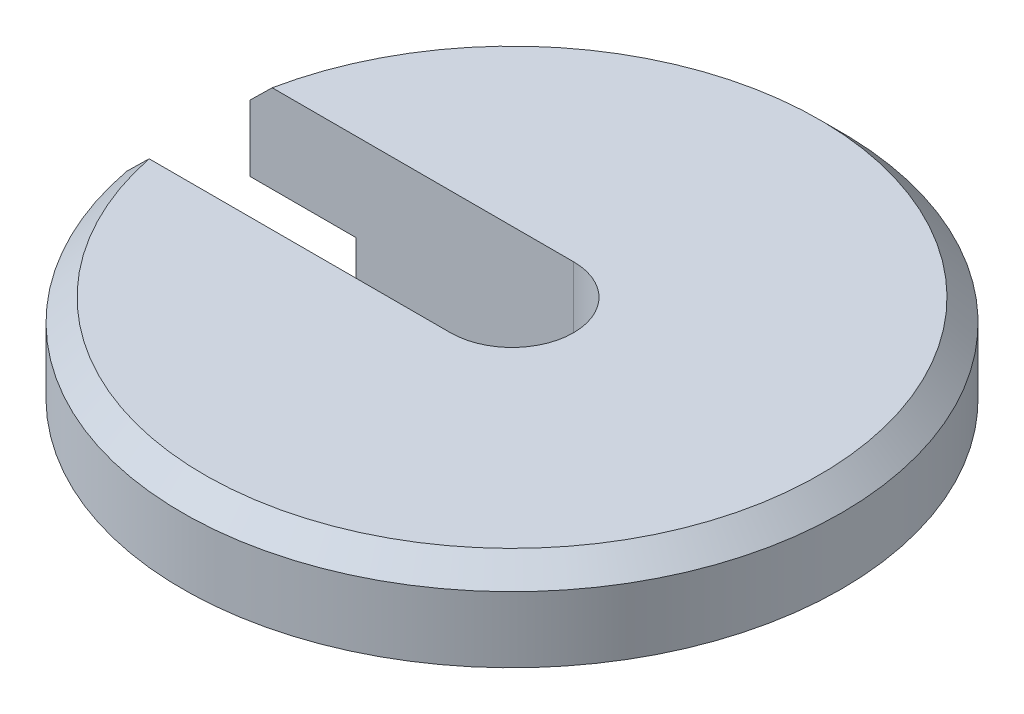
ISO-10303-21;
HEADER;
FILE_DESCRIPTION(('STEP AP214'),'2;1');
FILE_NAME('part.step','',(''),(''),'','','');
FILE_SCHEMA(('AUTOMOTIVE_DESIGN { 1 0 10303 214 1 1 1 1 }'));
ENDSEC;
DATA;
#1=APPLICATION_CONTEXT('core data for automotive mechanical design processes');
#2=APPLICATION_PROTOCOL_DEFINITION('international standard','automotive_design',2000,#1);
#3=PRODUCT_CONTEXT('',#1,'mechanical');
#4=PRODUCT('Part','Part','',(#3));
#5=PRODUCT_RELATED_PRODUCT_CATEGORY('part','',(#4));
#6=PRODUCT_DEFINITION_FORMATION('','',#4);
#7=PRODUCT_DEFINITION_CONTEXT('part definition',#1,'design');
#8=PRODUCT_DEFINITION('design','',#6,#7);
#9=PRODUCT_DEFINITION_SHAPE('','',#8);
#10=(LENGTH_UNIT() NAMED_UNIT(*) SI_UNIT(.MILLI.,.METRE.));
#11=(NAMED_UNIT(*) PLANE_ANGLE_UNIT() SI_UNIT($,.RADIAN.));
#12=(NAMED_UNIT(*) SI_UNIT($,.STERADIAN.) SOLID_ANGLE_UNIT());
#13=UNCERTAINTY_MEASURE_WITH_UNIT(LENGTH_MEASURE(1.E-05),#10,'distance_accuracy_value','');
#14=(GEOMETRIC_REPRESENTATION_CONTEXT(3) GLOBAL_UNCERTAINTY_ASSIGNED_CONTEXT((#13)) GLOBAL_UNIT_ASSIGNED_CONTEXT((#10,
#11,#12)) REPRESENTATION_CONTEXT('',''));
#15=CARTESIAN_POINT('',(0.,0.,0.));
#16=DIRECTION('',(0.,0.,1.));
#17=DIRECTION('',(1.,0.,0.));
#18=AXIS2_PLACEMENT_3D('',#15,#16,#17);
#19=CARTESIAN_POINT('',(0.,427.072746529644,0.));
#20=DIRECTION('',(0.,1.,0.));
#21=DIRECTION('',(-1.,0.,0.));
#22=AXIS2_PLACEMENT_3D('',#19,#20,#21);
#23=CYLINDRICAL_SURFACE('',#22,14.0000000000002);
#24=DIRECTION('',(0.,1.,0.));
#25=VECTOR('',#24,1.);
#26=CARTESIAN_POINT('',(0.,427.072746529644,14.0000000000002));
#27=LINE('',#26,#25);
#28=CARTESIAN_POINT('',(0.,385.,14.0000000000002));
#29=VERTEX_POINT('',#28);
#30=CARTESIAN_POINT('',(0.,415.,14.0000000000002));
#31=VERTEX_POINT('',#30);
#32=EDGE_CURVE('E112',#29,#31,#27,.T.);
#33=ORIENTED_EDGE('',*,*,#32,.T.);
#34=CARTESIAN_POINT('',(0.,415.,0.));
#35=DIRECTION('',(0.,1.,0.));
#36=DIRECTION('',(-1.,0.,0.));
#37=AXIS2_PLACEMENT_3D('',#34,#35,#36);
#38=CIRCLE('',#37,14.0000000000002);
#39=CARTESIAN_POINT('',(0.,415.,-14.0000000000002));
#40=VERTEX_POINT('',#39);
#41=EDGE_CURVE('E158',#31,#40,#38,.T.);
#42=ORIENTED_EDGE('',*,*,#41,.T.);
#43=DIRECTION('',(0.,1.,0.));
#44=VECTOR('',#43,1.);
#45=CARTESIAN_POINT('',(0.,427.072746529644,-14.0000000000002));
#46=LINE('',#45,#44);
#47=CARTESIAN_POINT('',(0.,385.,-14.0000000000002));
#48=VERTEX_POINT('',#47);
#49=EDGE_CURVE('E110',#48,#40,#46,.T.);
#50=ORIENTED_EDGE('',*,*,#49,.F.);
#51=CARTESIAN_POINT('',(0.,385.,0.));
#52=DIRECTION('',(0.,1.,0.));
#53=DIRECTION('',(-1.,0.,0.));
#54=AXIS2_PLACEMENT_3D('',#51,#52,#53);
#55=CIRCLE('',#54,14.0000000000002);
#56=EDGE_CURVE('E160',#29,#48,#55,.T.);
#57=ORIENTED_EDGE('',*,*,#56,.F.);
#58=EDGE_LOOP('',(#33,#42,#50,#57));
#59=FACE_BOUND('',#58,.T.);
#60=ADVANCED_FACE('F35',(#59),#23,.F.);
#61=CARTESIAN_POINT('',(-14.0000000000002,415.,0.));
#62=DIRECTION('',(0.,-1.,0.));
#63=DIRECTION('',(1.,0.,0.));
#64=AXIS2_PLACEMENT_3D('',#61,#62,#63);
#65=PLANE('',#64);
#66=ORIENTED_EDGE('',*,*,#41,.F.);
#67=DIRECTION('',(1.,0.,0.));
#68=VECTOR('',#67,1.);
#69=CARTESIAN_POINT('',(0.,415.,14.0000000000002));
#70=LINE('',#69,#68);
#71=CARTESIAN_POINT('',(-68.5857127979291,415.,14.0000000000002));
#72=VERTEX_POINT('',#71);
#73=EDGE_CURVE('E107',#72,#31,#70,.T.);
#74=ORIENTED_EDGE('',*,*,#73,.F.);
#75=CARTESIAN_POINT('',(0.,415.,0.));
#76=DIRECTION('',(0.,-1.,0.));
#77=DIRECTION('',(1.,0.,0.));
#78=AXIS2_PLACEMENT_3D('',#75,#76,#77);
#79=CIRCLE('',#78,70.0000000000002);
#80=CARTESIAN_POINT('',(-68.5857127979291,415.,-14.0000000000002));
#81=VERTEX_POINT('',#80);
#82=EDGE_CURVE('E43',#72,#81,#79,.F.);
#83=ORIENTED_EDGE('',*,*,#82,.T.);
#84=DIRECTION('',(-1.,0.,0.));
#85=VECTOR('',#84,1.);
#86=CARTESIAN_POINT('',(0.,415.,-14.0000000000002));
#87=LINE('',#86,#85);
#88=EDGE_CURVE('E50',#40,#81,#87,.T.);
#89=ORIENTED_EDGE('',*,*,#88,.F.);
#90=EDGE_LOOP('',(#66,#74,#83,#89));
#91=FACE_BOUND('',#90,.T.);
#92=ADVANCED_FACE('F146',(#91),#65,.F.);
#93=CARTESIAN_POINT('',(0.,427.072746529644,0.));
#94=DIRECTION('',(0.,1.,0.));
#95=DIRECTION('',(-1.,0.,0.));
#96=AXIS2_PLACEMENT_3D('',#93,#94,#95);
#97=CYLINDRICAL_SURFACE('',#96,75.0000000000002);
#98=CARTESIAN_POINT('',(0.,410.,0.));
#99=DIRECTION('',(0.,-1.,0.));
#100=DIRECTION('',(1.,0.,0.));
#101=AXIS2_PLACEMENT_3D('',#98,#99,#100);
#102=CIRCLE('',#101,75.0000000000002);
#103=CARTESIAN_POINT('',(-73.6817480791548,410.,-14.0000000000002));
#104=VERTEX_POINT('',#103);
#105=CARTESIAN_POINT('',(-73.6817480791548,410.,14.0000000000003));
#106=VERTEX_POINT('',#105);
#107=EDGE_CURVE('E11',#104,#106,#102,.T.);
#108=ORIENTED_EDGE('',*,*,#107,.T.);
#109=DIRECTION('',(0.,1.,0.));
#110=VECTOR('',#109,1.);
#111=CARTESIAN_POINT('',(-73.6817480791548,384.999,14.0000000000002));
#112=LINE('',#111,#110);
#113=CARTESIAN_POINT('',(-73.6817480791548,395.,14.0000000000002));
#114=VERTEX_POINT('',#113);
#115=EDGE_CURVE('E58',#114,#106,#112,.T.);
#116=ORIENTED_EDGE('',*,*,#115,.F.);
#117=CARTESIAN_POINT('',(0.,395.,0.));
#118=DIRECTION('',(0.,1.,0.));
#119=DIRECTION('',(-1.,0.,0.));
#120=AXIS2_PLACEMENT_3D('',#117,#118,#119);
#121=CIRCLE('',#120,75.0000000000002);
#122=CARTESIAN_POINT('',(-73.6817480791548,395.,-14.0000000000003));
#123=VERTEX_POINT('',#122);
#124=EDGE_CURVE('E106',#114,#123,#121,.T.);
#125=ORIENTED_EDGE('',*,*,#124,.T.);
#126=DIRECTION('',(0.,1.,0.));
#127=VECTOR('',#126,1.);
#128=CARTESIAN_POINT('',(-73.6817480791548,384.999,-14.0000000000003));
#129=LINE('',#128,#127);
#130=EDGE_CURVE('E94',#123,#104,#129,.T.);
#131=ORIENTED_EDGE('',*,*,#130,.T.);
#132=EDGE_LOOP('',(#108,#116,#125,#131));
#133=FACE_BOUND('',#132,.T.);
#134=ADVANCED_FACE('F104',(#133),#97,.T.);
#135=CARTESIAN_POINT('',(-51.5000000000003,395.,3.59622786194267E-13));
#136=DIRECTION('',(0.,1.,0.));
#137=DIRECTION('',(-1.,0.,0.));
#138=AXIS2_PLACEMENT_3D('',#135,#136,#137);
#139=PLANE('',#138);
#140=ORIENTED_EDGE('',*,*,#124,.F.);
#141=DIRECTION('',(-1.,0.,0.));
#142=VECTOR('',#141,1.);
#143=CARTESIAN_POINT('',(0.,395.,14.0000000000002));
#144=LINE('',#143,#142);
#145=CARTESIAN_POINT('',(-49.5605690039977,395.,14.0000000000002));
#146=VERTEX_POINT('',#145);
#147=EDGE_CURVE('E182',#146,#114,#144,.T.);
#148=ORIENTED_EDGE('',*,*,#147,.F.);
#149=CARTESIAN_POINT('',(0.,395.,0.));
#150=DIRECTION('',(0.,1.,0.));
#151=DIRECTION('',(-1.,0.,0.));
#152=AXIS2_PLACEMENT_3D('',#149,#150,#151);
#153=CIRCLE('',#152,51.5000000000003);
#154=CARTESIAN_POINT('',(-49.5605690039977,395.,-14.0000000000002));
#155=VERTEX_POINT('',#154);
#156=EDGE_CURVE('E164',#146,#155,#153,.T.);
#157=ORIENTED_EDGE('',*,*,#156,.T.);
#158=DIRECTION('',(1.,0.,0.));
#159=VECTOR('',#158,1.);
#160=CARTESIAN_POINT('',(0.,395.,-14.0000000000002));
#161=LINE('',#160,#159);
#162=EDGE_CURVE('E173',#123,#155,#161,.T.);
#163=ORIENTED_EDGE('',*,*,#162,.F.);
#164=EDGE_LOOP('',(#140,#148,#157,#163));
#165=FACE_BOUND('',#164,.T.);
#166=ADVANCED_FACE('F139',(#165),#139,.F.);
#167=CARTESIAN_POINT('',(0.,427.072746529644,0.));
#168=DIRECTION('',(0.,1.,0.));
#169=DIRECTION('',(-1.,0.,0.));
#170=AXIS2_PLACEMENT_3D('',#167,#168,#169);
#171=CYLINDRICAL_SURFACE('',#170,51.5000000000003);
#172=ORIENTED_EDGE('',*,*,#156,.F.);
#173=DIRECTION('',(0.,1.,0.));
#174=VECTOR('',#173,1.);
#175=CARTESIAN_POINT('',(-49.5605690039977,427.072746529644,14.0000000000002));
#176=LINE('',#175,#174);
#177=CARTESIAN_POINT('',(-49.5605690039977,385.,14.0000000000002));
#178=VERTEX_POINT('',#177);
#179=EDGE_CURVE('E184',#178,#146,#176,.T.);
#180=ORIENTED_EDGE('',*,*,#179,.F.);
#181=CARTESIAN_POINT('',(0.,385.,0.));
#182=DIRECTION('',(0.,1.,0.));
#183=DIRECTION('',(-1.,0.,0.));
#184=AXIS2_PLACEMENT_3D('',#181,#182,#183);
#185=CIRCLE('',#184,51.5000000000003);
#186=CARTESIAN_POINT('',(-49.5605690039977,385.,-14.0000000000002));
#187=VERTEX_POINT('',#186);
#188=EDGE_CURVE('E169',#178,#187,#185,.T.);
#189=ORIENTED_EDGE('',*,*,#188,.T.);
#190=DIRECTION('',(0.,1.,0.));
#191=VECTOR('',#190,1.);
#192=CARTESIAN_POINT('',(-49.5605690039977,427.072746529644,-14.0000000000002));
#193=LINE('',#192,#191);
#194=EDGE_CURVE('E175',#155,#187,#193,.F.);
#195=ORIENTED_EDGE('',*,*,#194,.F.);
#196=EDGE_LOOP('',(#172,#180,#189,#195));
#197=FACE_BOUND('',#196,.T.);
#198=ADVANCED_FACE('F135',(#197),#171,.T.);
#199=CARTESIAN_POINT('',(-51.5000000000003,385.,3.59622786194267E-13));
#200=DIRECTION('',(0.,1.,0.));
#201=DIRECTION('',(-1.,0.,0.));
#202=AXIS2_PLACEMENT_3D('',#199,#200,#201);
#203=PLANE('',#202);
#204=ORIENTED_EDGE('',*,*,#188,.F.);
#205=DIRECTION('',(-1.,0.,0.));
#206=VECTOR('',#205,1.);
#207=CARTESIAN_POINT('',(0.,385.,14.0000000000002));
#208=LINE('',#207,#206);
#209=EDGE_CURVE('E162',#29,#178,#208,.T.);
#210=ORIENTED_EDGE('',*,*,#209,.F.);
#211=ORIENTED_EDGE('',*,*,#56,.T.);
#212=DIRECTION('',(1.,0.,0.));
#213=VECTOR('',#212,1.);
#214=CARTESIAN_POINT('',(0.,385.,-14.0000000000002));
#215=LINE('',#214,#213);
#216=EDGE_CURVE('E177',#187,#48,#215,.T.);
#217=ORIENTED_EDGE('',*,*,#216,.F.);
#218=EDGE_LOOP('',(#204,#210,#211,#217));
#219=FACE_BOUND('',#218,.T.);
#220=ADVANCED_FACE('F132',(#219),#203,.F.);
#221=CARTESIAN_POINT('',(0.,415.,0.));
#222=DIRECTION('',(0.,-1.,0.));
#223=DIRECTION('',(1.,0.,0.));
#224=AXIS2_PLACEMENT_3D('',#221,#222,#223);
#225=CONICAL_SURFACE('',#224,70.0000000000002,0.785398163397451);
#226=CARTESIAN_POINT('',(-6.80542598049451,469.433567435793,14.0000000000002));
#227=CARTESIAN_POINT('',(-7.08250157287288,469.312410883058,14.0000000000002));
#228=CARTESIAN_POINT('',(-7.3573590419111,469.186285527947,14.0000000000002));
#229=CARTESIAN_POINT('',(-7.902802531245,468.925275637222,14.0000000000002));
#230=CARTESIAN_POINT('',(-8.17338963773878,468.79039337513,14.0000000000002));
#231=CARTESIAN_POINT('',(-8.71028982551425,468.513144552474,14.0000000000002));
#232=CARTESIAN_POINT('',(-8.97660748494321,468.370786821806,14.0000000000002));
#233=CARTESIAN_POINT('',(-9.50557357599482,468.079384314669,14.0000000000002));
#234=CARTESIAN_POINT('',(-9.76822173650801,467.930339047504,14.0000000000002));
#235=CARTESIAN_POINT('',(-10.5491149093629,467.475593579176,14.0000000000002));
#236=CARTESIAN_POINT('',(-11.0623225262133,467.161228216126,14.0000000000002));
#237=CARTESIAN_POINT('',(-12.0774471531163,466.514552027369,14.0000000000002));
#238=CARTESIAN_POINT('',(-12.5793602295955,466.182235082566,14.0000000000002));
#239=CARTESIAN_POINT('',(-13.5710778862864,465.505294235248,14.0000000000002));
#240=CARTESIAN_POINT('',(-14.0609307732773,465.160740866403,14.0000000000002));
#241=CARTESIAN_POINT('',(-15.0326738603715,464.460578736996,14.0000000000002));
#242=CARTESIAN_POINT('',(-15.5145637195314,464.104969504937,14.0000000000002));
#243=CARTESIAN_POINT('',(-16.4721587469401,463.384438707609,14.0000000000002));
#244=CARTESIAN_POINT('',(-16.9478563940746,463.019507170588,14.0000000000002));
#245=CARTESIAN_POINT('',(-17.8935660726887,462.282341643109,14.0000000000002));
#246=CARTESIAN_POINT('',(-18.3635779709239,461.91010748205,14.0000000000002));
#247=CARTESIAN_POINT('',(-19.2921149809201,461.164939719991,14.0000000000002));
#248=CARTESIAN_POINT('',(-19.7507084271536,460.792091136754,14.0000000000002));
#249=CARTESIAN_POINT('',(-20.663862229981,460.041482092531,14.0000000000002));
#250=CARTESIAN_POINT('',(-21.118422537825,459.663721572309,14.0000000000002));
#251=CARTESIAN_POINT('',(-22.024083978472,458.904033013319,14.0000000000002));
#252=CARTESIAN_POINT('',(-22.4751849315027,458.522104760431,14.0000000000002));
#253=CARTESIAN_POINT('',(-23.3743645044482,457.754704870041,14.0000000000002));
#254=CARTESIAN_POINT('',(-23.8224431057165,457.369233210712,14.0000000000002));
#255=CARTESIAN_POINT('',(-25.1629271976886,456.208111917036,14.0000000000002));
#256=CARTESIAN_POINT('',(-26.0513937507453,455.427913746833,14.0000000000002));
#257=CARTESIAN_POINT('',(-27.8201972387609,453.858427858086,14.0000000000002));
#258=CARTESIAN_POINT('',(-28.7005343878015,453.069140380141,14.0000000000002));
#259=CARTESIAN_POINT('',(-30.4548930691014,451.483441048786,14.0000000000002));
#260=CARTESIAN_POINT('',(-31.3289140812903,450.687028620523,14.0000000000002));
#261=CARTESIAN_POINT('',(-33.0718479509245,449.088629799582,14.0000000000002));
#262=CARTESIAN_POINT('',(-33.9407607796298,448.286643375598,14.0000000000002));
#263=CARTESIAN_POINT('',(-35.6743224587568,446.678299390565,14.0000000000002));
#264=CARTESIAN_POINT('',(-36.5389718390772,445.871942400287,14.0000000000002));
#265=CARTESIAN_POINT('',(-38.2648521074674,444.255583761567,14.0000000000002));
#266=CARTESIAN_POINT('',(-39.1260830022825,443.445582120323,14.0000000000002));
#267=CARTESIAN_POINT('',(-40.85008300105,441.818433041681,14.0000000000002));
#268=CARTESIAN_POINT('',(-41.7128375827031,441.001270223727,14.0000000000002));
#269=CARTESIAN_POINT('',(-43.435930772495,439.364401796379,14.0000000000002));
#270=CARTESIAN_POINT('',(-44.2962693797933,438.5446961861,14.0000000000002));
#271=CARTESIAN_POINT('',(-46.8742810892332,436.082333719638,14.0000000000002));
#272=CARTESIAN_POINT('',(-48.5888997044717,434.436478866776,14.0000000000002));
#273=CARTESIAN_POINT('',(-52.0118252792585,431.138879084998,14.0000000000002));
#274=CARTESIAN_POINT('',(-53.7201333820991,429.487135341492,14.0000000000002));
#275=CARTESIAN_POINT('',(-57.1322068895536,426.178961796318,14.0000000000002));
#276=CARTESIAN_POINT('',(-58.8359722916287,424.522531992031,14.0000000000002));
#277=CARTESIAN_POINT('',(-61.1386397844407,422.279069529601,14.0000000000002));
#278=CARTESIAN_POINT('',(-61.7390867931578,421.693621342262,14.0000000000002));
#279=CARTESIAN_POINT('',(-62.9395843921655,420.522298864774,14.0000000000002));
#280=CARTESIAN_POINT('',(-63.5396349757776,419.936424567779,14.0000000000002));
#281=CARTESIAN_POINT('',(-64.7385918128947,418.765047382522,14.0000000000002));
#282=CARTESIAN_POINT('',(-65.3374985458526,418.179544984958,14.0000000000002));
#283=CARTESIAN_POINT('',(-66.5349643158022,417.008191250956,14.0000000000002));
#284=CARTESIAN_POINT('',(-67.1335233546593,416.422339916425,14.0000000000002));
#285=CARTESIAN_POINT('',(-70.1365704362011,413.481464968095,14.0000000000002));
#286=CARTESIAN_POINT('',(-72.5386678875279,411.123999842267,14.0000000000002));
#287=CARTESIAN_POINT('',(-77.3390787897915,406.405219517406,14.0000000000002));
#288=CARTESIAN_POINT('',(-79.7373922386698,404.043904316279,14.0000000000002));
#289=CARTESIAN_POINT('',(-84.5311318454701,399.318320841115,14.0000000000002));
#290=CARTESIAN_POINT('',(-86.9265579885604,396.954052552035,14.0000000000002));
#291=CARTESIAN_POINT('',(-91.7151445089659,392.223222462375,14.0000000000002));
#292=CARTESIAN_POINT('',(-94.1083048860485,389.856660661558,14.0000000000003));
#293=CARTESIAN_POINT('',(-98.9079398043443,385.106751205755,14.0000000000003));
#294=CARTESIAN_POINT('',(-101.314402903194,382.723391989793,14.0000000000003));
#295=CARTESIAN_POINT('',(-106.125851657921,377.955182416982,14.0000000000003));
#296=CARTESIAN_POINT('',(-108.530837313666,375.570332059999,14.0000000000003));
#297=CARTESIAN_POINT('',(-113.33957744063,370.799435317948,14.0000000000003));
#298=CARTESIAN_POINT('',(-115.743331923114,368.413388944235,14.0000000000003));
#299=CARTESIAN_POINT('',(-120.549828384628,363.640277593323,14.0000000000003));
#300=CARTESIAN_POINT('',(-122.95257036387,361.253212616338,14.0000000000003));
#301=CARTESIAN_POINT('',(-125.354904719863,358.865737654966,14.0000000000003));
#302=B_SPLINE_CURVE_WITH_KNOTS('',3,(#226,#227,#228,#229,#230,#231,#232,#233,#234,#235,#236,
#237,#238,#239,#240,#241,#242,#243,#244,#245,#246,#247,#248,#249,#250,#251,#252,#253,#254,#255,
#256,#257,#258,#259,#260,#261,#262,#263,#264,#265,#266,#267,#268,#269,#270,#271,#272,#273,#274,
#275,#276,#277,#278,#279,#280,#281,#282,#283,#284,#285,#286,#287,#288,#289,#290,#291,#292,#293,
#294,#295,#296,#297,#298,#299,#300,#301),.UNSPECIFIED.,.F.,.F.,(4,2,2,2,2,2,2,2,2,2,2,2,2,2,2,2,
2,2,2,2,2,2,2,2,2,2,2,2,2,2,2,2,2,2,2,2,2,4),(0.,0.907110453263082,1.81398633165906,
2.71981411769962,3.6257084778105,5.43068273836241,7.23627618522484,9.03276192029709,
10.8293243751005,12.6278964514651,14.4265105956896,16.1995798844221,17.9726705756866,
19.7458527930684,21.5190459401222,25.0661666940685,28.6131937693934,32.1605096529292,
35.7078454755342,39.254728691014,42.8016049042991,46.3665538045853,49.9315039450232,
57.0616122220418,64.1903582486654,71.3191082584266,73.83497298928,76.3508790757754,
78.8635510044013,81.3762093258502,91.473203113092,101.57020239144,111.667253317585,
121.764305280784,131.92517020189,142.086036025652,152.246807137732,162.407576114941),.UNSPECIFIED.);
#303=EDGE_CURVE('E100',#72,#106,#302,.T.);
#304=ORIENTED_EDGE('',*,*,#303,.T.);
#305=ORIENTED_EDGE('',*,*,#107,.F.);
#306=CARTESIAN_POINT('',(-125.354904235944,358.865738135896,-14.0000000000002));
#307=CARTESIAN_POINT('',(-122.958693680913,361.247127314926,-14.0000000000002));
#308=CARTESIAN_POINT('',(-120.562077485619,363.628108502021,-14.0000000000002));
#309=CARTESIAN_POINT('',(-115.767845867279,368.389050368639,-14.0000000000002));
#310=CARTESIAN_POINT('',(-113.370230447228,370.769011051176,-14.0000000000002));
#311=CARTESIAN_POINT('',(-108.574546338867,375.526979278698,-14.0000000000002));
#312=CARTESIAN_POINT('',(-106.176478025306,377.90498720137,-14.0000000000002));
#313=CARTESIAN_POINT('',(-101.378867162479,382.659530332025,-14.0000000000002));
#314=CARTESIAN_POINT('',(-98.9793246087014,385.036065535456,-14.0000000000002));
#315=CARTESIAN_POINT('',(-94.1804708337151,389.78528149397,-14.0000000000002));
#316=CARTESIAN_POINT('',(-91.7811611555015,392.157963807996,-14.0000000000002));
#317=CARTESIAN_POINT('',(-86.9802903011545,396.901005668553,-14.0000000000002));
#318=CARTESIAN_POINT('',(-84.5787291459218,399.271365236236,-14.0000000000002));
#319=CARTESIAN_POINT('',(-79.7719985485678,404.009824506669,-14.0000000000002));
#320=CARTESIAN_POINT('',(-77.3668282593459,406.377923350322,-14.0000000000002));
#321=CARTESIAN_POINT('',(-72.552597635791,411.110325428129,-14.0000000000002));
#322=CARTESIAN_POINT('',(-70.1435371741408,413.474628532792,-14.0000000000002));
#323=CARTESIAN_POINT('',(-65.3160139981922,418.202235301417,-14.0000000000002));
#324=CARTESIAN_POINT('',(-62.8975421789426,420.565529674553,-14.0000000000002));
#325=CARTESIAN_POINT('',(-59.2646225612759,424.104831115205,-14.0000000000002));
#326=CARTESIAN_POINT('',(-58.0528535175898,425.283587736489,-14.0000000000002));
#327=CARTESIAN_POINT('',(-55.6271661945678,427.638887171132,-14.0000000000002));
#328=CARTESIAN_POINT('',(-54.4132479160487,428.81542998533,-14.0000000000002));
#329=CARTESIAN_POINT('',(-51.9839425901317,431.164743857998,-14.0000000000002));
#330=CARTESIAN_POINT('',(-50.7685579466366,432.337517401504,-14.0000000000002));
#331=CARTESIAN_POINT('',(-48.334627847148,434.679758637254,-14.0000000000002));
#332=CARTESIAN_POINT('',(-47.116082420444,435.849226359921,-14.0000000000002));
#333=CARTESIAN_POINT('',(-44.6745403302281,438.184537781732,-14.0000000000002));
#334=CARTESIAN_POINT('',(-43.4515420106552,439.350379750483,-14.0000000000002));
#335=CARTESIAN_POINT('',(-41.0005250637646,441.676862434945,-14.0000000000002));
#336=CARTESIAN_POINT('',(-39.7725062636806,442.837502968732,-14.0000000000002));
#337=CARTESIAN_POINT('',(-37.3060717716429,445.155746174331,-14.0000000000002));
#338=CARTESIAN_POINT('',(-36.067635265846,446.313326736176,-14.0000000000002));
#339=CARTESIAN_POINT('',(-34.2036750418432,448.042753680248,-14.0000000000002));
#340=CARTESIAN_POINT('',(-33.5813410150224,448.618038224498,-14.0000000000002));
#341=CARTESIAN_POINT('',(-32.3341960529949,449.765915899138,-14.0000000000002));
#342=CARTESIAN_POINT('',(-31.7093851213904,450.338509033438,-14.0000000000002));
#343=CARTESIAN_POINT('',(-30.45775926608,451.479720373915,-14.0000000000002));
#344=CARTESIAN_POINT('',(-29.8309484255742,452.048343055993,-14.0000000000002));
#345=CARTESIAN_POINT('',(-28.5739380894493,453.181827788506,-14.0000000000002));
#346=CARTESIAN_POINT('',(-27.9437386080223,453.746689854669,-14.0000000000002));
#347=CARTESIAN_POINT('',(-26.6790281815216,454.872151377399,-14.0000000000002));
#348=CARTESIAN_POINT('',(-26.0445154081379,455.432748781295,-14.0000000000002));
#349=CARTESIAN_POINT('',(-24.7706681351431,456.548436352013,-14.0000000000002));
#350=CARTESIAN_POINT('',(-24.1313336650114,457.103526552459,-14.0000000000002));
#351=CARTESIAN_POINT('',(-22.8435472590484,458.209734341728,-14.0000000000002));
#352=CARTESIAN_POINT('',(-22.1950654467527,458.760817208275,-14.0000000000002));
#353=CARTESIAN_POINT('',(-20.890911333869,459.854346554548,-14.0000000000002));
#354=CARTESIAN_POINT('',(-20.2352394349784,460.396793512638,-14.0000000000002));
#355=CARTESIAN_POINT('',(-18.9157847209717,461.470029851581,-14.0000000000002));
#356=CARTESIAN_POINT('',(-18.2520134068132,462.000833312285,-14.0000000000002));
#357=CARTESIAN_POINT('',(-17.2478737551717,462.786357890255,-14.0000000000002));
#358=CARTESIAN_POINT('',(-16.9117049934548,463.04645056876,-14.0000000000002));
#359=CARTESIAN_POINT('',(-16.2362042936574,463.562491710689,-14.0000000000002));
#360=CARTESIAN_POINT('',(-15.8968724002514,463.818440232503,-14.0000000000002));
#361=CARTESIAN_POINT('',(-15.2126842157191,464.326995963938,-14.0000000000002));
#362=CARTESIAN_POINT('',(-14.8678074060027,464.579575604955,-14.0000000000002));
#363=CARTESIAN_POINT('',(-14.1739738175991,465.079067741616,-14.0000000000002));
#364=CARTESIAN_POINT('',(-13.8250170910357,465.325980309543,-14.0000000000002));
#365=CARTESIAN_POINT('',(-13.1226770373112,465.813008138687,-14.0000000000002));
#366=CARTESIAN_POINT('',(-12.7692963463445,466.053127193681,-14.0000000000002));
#367=CARTESIAN_POINT('',(-12.0573096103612,466.525483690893,-14.0000000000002));
#368=CARTESIAN_POINT('',(-11.6987037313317,466.757721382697,-14.0000000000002));
#369=CARTESIAN_POINT('',(-10.973919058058,467.213847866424,-14.0000000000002));
#370=CARTESIAN_POINT('',(-10.6077132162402,467.437693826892,-14.0000000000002));
#371=CARTESIAN_POINT('',(-9.86862692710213,467.87397231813,-14.0000000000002));
#372=CARTESIAN_POINT('',(-9.49574760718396,468.08640675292,-14.0000000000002));
#373=CARTESIAN_POINT('',(-8.74165256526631,468.497986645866,-14.0000000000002));
#374=CARTESIAN_POINT('',(-8.3604209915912,468.697103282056,-14.0000000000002));
#375=CARTESIAN_POINT('',(-7.78225640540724,468.983274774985,-14.0000000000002));
#376=CARTESIAN_POINT('',(-7.58842243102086,469.076607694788,-14.0000000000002));
#377=CARTESIAN_POINT('',(-7.19857570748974,469.258659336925,-14.0000000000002));
#378=CARTESIAN_POINT('',(-7.00256272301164,469.347377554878,-14.0000000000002));
#379=CARTESIAN_POINT('',(-6.8054266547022,469.433567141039,-14.0000000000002));
#380=B_SPLINE_CURVE_WITH_KNOTS('',3,(#306,#307,#308,#309,#310,#311,#312,#313,#314,#315,#316,
#317,#318,#319,#320,#321,#322,#323,#324,#325,#326,#327,#328,#329,#330,#331,#332,#333,#334,#335,
#336,#337,#338,#339,#340,#341,#342,#343,#344,#345,#346,#347,#348,#349,#350,#351,#352,#353,#354,
#355,#356,#357,#358,#359,#360,#361,#362,#363,#364,#365,#366,#367,#368,#369,#370,#371,#372,#373,
#374,#375,#376,#377,#378,#379),.UNSPECIFIED.,.F.,.F.,(4,2,2,2,2,2,2,2,2,2,2,2,2,2,2,2,2,2,2,2,2,
2,2,2,2,2,2,2,2,2,2,2,2,2,2,2,4),(0.,10.134868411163,20.2697066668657,30.4013831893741,
40.5330908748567,50.6561709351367,60.7791579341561,70.9050928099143,81.0313660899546,
91.1756864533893,96.2472385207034,101.318788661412,106.385638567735,111.452441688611,
116.521375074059,121.590484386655,126.676057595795,129.218543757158,131.761026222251,
134.29991340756,136.838789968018,139.378819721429,141.918833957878,144.471808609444,
147.024641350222,149.574194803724,150.849284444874,152.124356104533,153.406737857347,
154.68910324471,155.970737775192,157.25233168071,158.539761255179,159.826975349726,
161.116890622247,161.762238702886,162.407657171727),.UNSPECIFIED.);
#381=EDGE_CURVE('E91',#104,#81,#380,.T.);
#382=ORIENTED_EDGE('',*,*,#381,.T.);
#383=ORIENTED_EDGE('',*,*,#82,.F.);
#384=EDGE_LOOP('',(#304,#305,#382,#383));
#385=FACE_BOUND('',#384,.T.);
#386=ADVANCED_FACE('F37',(#385),#225,.T.);
#387=CARTESIAN_POINT('',(0.,384.999,-14.0000000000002));
#388=DIRECTION('',(0.,0.,-1.));
#389=DIRECTION('',(-1.,0.,0.));
#390=AXIS2_PLACEMENT_3D('',#387,#388,#389);
#391=PLANE('',#390);
#392=ORIENTED_EDGE('',*,*,#162,.T.);
#393=ORIENTED_EDGE('',*,*,#194,.T.);
#394=ORIENTED_EDGE('',*,*,#216,.T.);
#395=ORIENTED_EDGE('',*,*,#49,.T.);
#396=ORIENTED_EDGE('',*,*,#88,.T.);
#397=ORIENTED_EDGE('',*,*,#381,.F.);
#398=ORIENTED_EDGE('',*,*,#130,.F.);
#399=EDGE_LOOP('',(#392,#393,#394,#395,#396,#397,#398));
#400=FACE_BOUND('',#399,.T.);
#401=ADVANCED_FACE('F93',(#400),#391,.F.);
#402=CARTESIAN_POINT('',(0.,384.999,14.0000000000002));
#403=DIRECTION('',(0.,0.,1.));
#404=DIRECTION('',(1.,0.,0.));
#405=AXIS2_PLACEMENT_3D('',#402,#403,#404);
#406=PLANE('',#405);
#407=ORIENTED_EDGE('',*,*,#147,.T.);
#408=ORIENTED_EDGE('',*,*,#115,.T.);
#409=ORIENTED_EDGE('',*,*,#303,.F.);
#410=ORIENTED_EDGE('',*,*,#73,.T.);
#411=ORIENTED_EDGE('',*,*,#32,.F.);
#412=ORIENTED_EDGE('',*,*,#209,.T.);
#413=ORIENTED_EDGE('',*,*,#179,.T.);
#414=EDGE_LOOP('',(#407,#408,#409,#410,#411,#412,#413));
#415=FACE_BOUND('',#414,.T.);
#416=ADVANCED_FACE('F124',(#415),#406,.F.);
#417=CLOSED_SHELL('',(#60,#92,#134,#166,#198,#220,#386,#401,#416));
#418=MANIFOLD_SOLID_BREP('B2',#417);
#419=ADVANCED_BREP_SHAPE_REPRESENTATION('',(#18,#418),#14);
#420=SHAPE_DEFINITION_REPRESENTATION(#9,#419);
ENDSEC;
END-ISO-10303-21;
